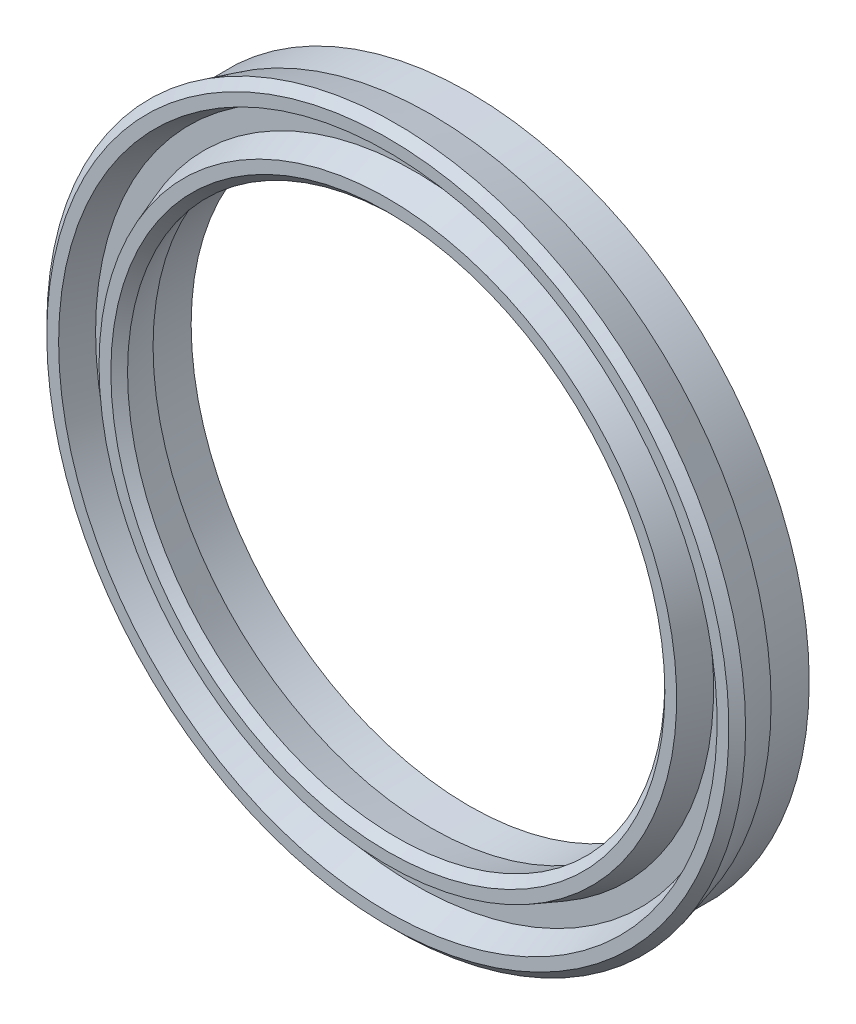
ISO-10303-21;
HEADER;
FILE_DESCRIPTION(('STEP AP214'),'2;1');
FILE_NAME('part.step','',(''),(''),'','','');
FILE_SCHEMA(('AUTOMOTIVE_DESIGN { 1 0 10303 214 1 1 1 1 }'));
ENDSEC;
DATA;
#1=APPLICATION_CONTEXT('core data for automotive mechanical design processes');
#2=APPLICATION_PROTOCOL_DEFINITION('international standard','automotive_design',2000,#1);
#3=PRODUCT_CONTEXT('',#1,'mechanical');
#4=PRODUCT('Part','Part','',(#3));
#5=PRODUCT_RELATED_PRODUCT_CATEGORY('part','',(#4));
#6=PRODUCT_DEFINITION_FORMATION('','',#4);
#7=PRODUCT_DEFINITION_CONTEXT('part definition',#1,'design');
#8=PRODUCT_DEFINITION('design','',#6,#7);
#9=PRODUCT_DEFINITION_SHAPE('','',#8);
#10=(LENGTH_UNIT() NAMED_UNIT(*) SI_UNIT(.MILLI.,.METRE.));
#11=(NAMED_UNIT(*) PLANE_ANGLE_UNIT() SI_UNIT($,.RADIAN.));
#12=(NAMED_UNIT(*) SI_UNIT($,.STERADIAN.) SOLID_ANGLE_UNIT());
#13=UNCERTAINTY_MEASURE_WITH_UNIT(LENGTH_MEASURE(1.E-05),#10,'distance_accuracy_value','');
#14=(GEOMETRIC_REPRESENTATION_CONTEXT(3) GLOBAL_UNCERTAINTY_ASSIGNED_CONTEXT((#13)) GLOBAL_UNIT_ASSIGNED_CONTEXT((#10,
#11,#12)) REPRESENTATION_CONTEXT('',''));
#15=CARTESIAN_POINT('',(0.,0.,0.));
#16=DIRECTION('',(0.,0.,1.));
#17=DIRECTION('',(1.,0.,0.));
#18=AXIS2_PLACEMENT_3D('',#15,#16,#17);
#19=CARTESIAN_POINT('',(0.,0.,0.));
#20=DIRECTION('',(0.,0.,-1.));
#21=DIRECTION('',(-1.,0.,0.));
#22=AXIS2_PLACEMENT_3D('',#19,#20,#21);
#23=CONICAL_SURFACE('',#22,52.5710801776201,0.349065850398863);
#24=CARTESIAN_POINT('',(0.,0.,-4.93333333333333));
#25=DIRECTION('',(0.,0.,-1.));
#26=DIRECTION('',(-1.,0.,0.));
#27=AXIS2_PLACEMENT_3D('',#24,#25,#26);
#28=CIRCLE('',#27,54.3666666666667);
#29=CARTESIAN_POINT('',(-54.3666666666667,0.,-4.93333333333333));
#30=VERTEX_POINT('',#29);
#31=EDGE_CURVE('E10',#30,#30,#28,.T.);
#32=ORIENTED_EDGE('',*,*,#31,.F.);
#33=EDGE_LOOP('',(#32));
#34=FACE_BOUND('',#33,.T.);
#35=CARTESIAN_POINT('',(0.,0.,0.));
#36=DIRECTION('',(0.,0.,-1.));
#37=DIRECTION('',(-1.,0.,0.));
#38=AXIS2_PLACEMENT_3D('',#35,#36,#37);
#39=CIRCLE('',#38,52.5710801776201);
#40=CARTESIAN_POINT('',(-52.5710801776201,0.,0.));
#41=VERTEX_POINT('',#40);
#42=EDGE_CURVE('E71',#41,#41,#39,.T.);
#43=ORIENTED_EDGE('',*,*,#42,.T.);
#44=EDGE_LOOP('',(#43));
#45=FACE_BOUND('',#44,.T.);
#46=ADVANCED_FACE('F31',(#34,#45),#23,.T.);
#47=CARTESIAN_POINT('',(58.1333333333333,0.,-4.93333333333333));
#48=DIRECTION('',(0.,0.,-1.));
#49=DIRECTION('',(-1.,0.,0.));
#50=AXIS2_PLACEMENT_3D('',#47,#48,#49);
#51=PLANE('',#50);
#52=CARTESIAN_POINT('',(0.,0.,-4.93333333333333));
#53=DIRECTION('',(0.,0.,-1.));
#54=DIRECTION('',(-1.,0.,0.));
#55=AXIS2_PLACEMENT_3D('',#52,#53,#54);
#56=CIRCLE('',#55,58.1333333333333);
#57=CARTESIAN_POINT('',(-58.1333333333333,0.,-4.93333333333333));
#58=VERTEX_POINT('',#57);
#59=EDGE_CURVE('E37',#58,#58,#56,.T.);
#60=ORIENTED_EDGE('',*,*,#59,.F.);
#61=EDGE_LOOP('',(#60));
#62=FACE_BOUND('',#61,.T.);
#63=ORIENTED_EDGE('',*,*,#31,.T.);
#64=EDGE_LOOP('',(#63));
#65=FACE_BOUND('',#64,.T.);
#66=ADVANCED_FACE('F132',(#62,#65),#51,.F.);
#67=CARTESIAN_POINT('',(0.,0.,-4.93333333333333));
#68=DIRECTION('',(0.,0.,1.));
#69=DIRECTION('',(1.,0.,0.));
#70=AXIS2_PLACEMENT_3D('',#67,#68,#69);
#71=CONICAL_SURFACE('',#70,58.1333333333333,0.349065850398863);
#72=CARTESIAN_POINT('',(0.,0.,0.));
#73=DIRECTION('',(0.,0.,-1.));
#74=DIRECTION('',(-1.,0.,0.));
#75=AXIS2_PLACEMENT_3D('',#72,#73,#74);
#76=CIRCLE('',#75,59.9289198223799);
#77=CARTESIAN_POINT('',(-59.9289198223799,0.,0.));
#78=VERTEX_POINT('',#77);
#79=EDGE_CURVE('E41',#78,#78,#76,.T.);
#80=ORIENTED_EDGE('',*,*,#79,.F.);
#81=EDGE_LOOP('',(#80));
#82=FACE_BOUND('',#81,.T.);
#83=ORIENTED_EDGE('',*,*,#59,.T.);
#84=EDGE_LOOP('',(#83));
#85=FACE_BOUND('',#84,.T.);
#86=ADVANCED_FACE('F127',(#82,#85),#71,.F.);
#87=CARTESIAN_POINT('',(62.0793888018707,0.,0.));
#88=DIRECTION('',(0.,0.,-1.));
#89=DIRECTION('',(-1.,0.,0.));
#90=AXIS2_PLACEMENT_3D('',#87,#88,#89);
#91=PLANE('',#90);
#92=CARTESIAN_POINT('',(0.,0.,0.));
#93=DIRECTION('',(0.,0.,-1.));
#94=DIRECTION('',(-1.,0.,0.));
#95=AXIS2_PLACEMENT_3D('',#92,#93,#94);
#96=CIRCLE('',#95,62.0793888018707);
#97=CARTESIAN_POINT('',(-62.0793888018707,0.,0.));
#98=VERTEX_POINT('',#97);
#99=EDGE_CURVE('E45',#98,#98,#96,.T.);
#100=ORIENTED_EDGE('',*,*,#99,.F.);
#101=EDGE_LOOP('',(#100));
#102=FACE_BOUND('',#101,.T.);
#103=ORIENTED_EDGE('',*,*,#79,.T.);
#104=EDGE_LOOP('',(#103));
#105=FACE_BOUND('',#104,.T.);
#106=ADVANCED_FACE('F121',(#102,#105),#91,.F.);
#107=CARTESIAN_POINT('',(0.,0.,0.));
#108=DIRECTION('',(0.,0.,-1.));
#109=DIRECTION('',(-1.,0.,0.));
#110=AXIS2_PLACEMENT_3D('',#107,#108,#109);
#111=CONICAL_SURFACE('',#110,62.0793888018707,0.785398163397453);
#112=CARTESIAN_POINT('',(0.,0.,-1.52061119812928));
#113=DIRECTION('',(0.,0.,-1.));
#114=DIRECTION('',(-1.,0.,0.));
#115=AXIS2_PLACEMENT_3D('',#112,#113,#114);
#116=CIRCLE('',#115,63.6);
#117=CARTESIAN_POINT('',(-63.6,0.,-1.52061119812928));
#118=VERTEX_POINT('',#117);
#119=EDGE_CURVE('E50',#118,#118,#116,.T.);
#120=ORIENTED_EDGE('',*,*,#119,.F.);
#121=EDGE_LOOP('',(#120));
#122=FACE_BOUND('',#121,.T.);
#123=ORIENTED_EDGE('',*,*,#99,.T.);
#124=EDGE_LOOP('',(#123));
#125=FACE_BOUND('',#124,.T.);
#126=ADVANCED_FACE('F115',(#122,#125),#111,.T.);
#127=CARTESIAN_POINT('',(0.,0.,-1.52061119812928));
#128=DIRECTION('',(0.,0.,1.));
#129=DIRECTION('',(1.,0.,0.));
#130=AXIS2_PLACEMENT_3D('',#127,#128,#129);
#131=CONICAL_SURFACE('',#130,63.6,0.261799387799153);
#132=CARTESIAN_POINT('',(0.,0.,-7.86509757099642));
#133=DIRECTION('',(0.,0.,-1.));
#134=DIRECTION('',(-1.,0.,0.));
#135=AXIS2_PLACEMENT_3D('',#132,#133,#134);
#136=CIRCLE('',#135,61.9);
#137=CARTESIAN_POINT('',(-61.9,0.,-7.86509757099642));
#138=VERTEX_POINT('',#137);
#139=EDGE_CURVE('E53',#138,#138,#136,.T.);
#140=ORIENTED_EDGE('',*,*,#139,.F.);
#141=EDGE_LOOP('',(#140));
#142=FACE_BOUND('',#141,.T.);
#143=ORIENTED_EDGE('',*,*,#119,.T.);
#144=EDGE_LOOP('',(#143));
#145=FACE_BOUND('',#144,.T.);
#146=ADVANCED_FACE('F109',(#142,#145),#131,.T.);
#147=CARTESIAN_POINT('',(0.,0.,-14.8));
#148=DIRECTION('',(0.,0.,-1.));
#149=DIRECTION('',(-1.,0.,0.));
#150=AXIS2_PLACEMENT_3D('',#147,#148,#149);
#151=CYLINDRICAL_SURFACE('',#150,61.9);
#152=CARTESIAN_POINT('',(0.,0.,-14.8));
#153=DIRECTION('',(0.,0.,-1.));
#154=DIRECTION('',(-1.,0.,0.));
#155=AXIS2_PLACEMENT_3D('',#152,#153,#154);
#156=CIRCLE('',#155,61.9);
#157=CARTESIAN_POINT('',(-61.9,0.,-14.8));
#158=VERTEX_POINT('',#157);
#159=EDGE_CURVE('E56',#158,#158,#156,.T.);
#160=ORIENTED_EDGE('',*,*,#159,.F.);
#161=EDGE_LOOP('',(#160));
#162=FACE_BOUND('',#161,.T.);
#163=ORIENTED_EDGE('',*,*,#139,.T.);
#164=EDGE_LOOP('',(#163));
#165=FACE_BOUND('',#164,.T.);
#166=ADVANCED_FACE('F103',(#162,#165),#151,.T.);
#167=CARTESIAN_POINT('',(50.6,0.,-14.8));
#168=DIRECTION('',(0.,0.,1.));
#169=DIRECTION('',(1.,0.,0.));
#170=AXIS2_PLACEMENT_3D('',#167,#168,#169);
#171=PLANE('',#170);
#172=CARTESIAN_POINT('',(0.,0.,-14.8));
#173=DIRECTION('',(0.,0.,-1.));
#174=DIRECTION('',(-1.,0.,0.));
#175=AXIS2_PLACEMENT_3D('',#172,#173,#174);
#176=CIRCLE('',#175,50.6);
#177=CARTESIAN_POINT('',(-50.6,0.,-14.8));
#178=VERTEX_POINT('',#177);
#179=EDGE_CURVE('E59',#178,#178,#176,.T.);
#180=ORIENTED_EDGE('',*,*,#179,.F.);
#181=EDGE_LOOP('',(#180));
#182=FACE_BOUND('',#181,.T.);
#183=ORIENTED_EDGE('',*,*,#159,.T.);
#184=EDGE_LOOP('',(#183));
#185=FACE_BOUND('',#184,.T.);
#186=ADVANCED_FACE('F97',(#182,#185),#171,.F.);
#187=CARTESIAN_POINT('',(0.,0.,-14.8));
#188=DIRECTION('',(0.,0.,-1.));
#189=DIRECTION('',(-1.,0.,0.));
#190=AXIS2_PLACEMENT_3D('',#187,#188,#189);
#191=CYLINDRICAL_SURFACE('',#190,50.6);
#192=CARTESIAN_POINT('',(0.,0.,-7.86509757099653));
#193=DIRECTION('',(0.,0.,-1.));
#194=DIRECTION('',(-1.,0.,0.));
#195=AXIS2_PLACEMENT_3D('',#192,#193,#194);
#196=CIRCLE('',#195,50.6);
#197=CARTESIAN_POINT('',(-50.6,0.,-7.86509757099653));
#198=VERTEX_POINT('',#197);
#199=EDGE_CURVE('E62',#198,#198,#196,.T.);
#200=ORIENTED_EDGE('',*,*,#199,.F.);
#201=EDGE_LOOP('',(#200));
#202=FACE_BOUND('',#201,.T.);
#203=ORIENTED_EDGE('',*,*,#179,.T.);
#204=EDGE_LOOP('',(#203));
#205=FACE_BOUND('',#204,.T.);
#206=ADVANCED_FACE('F91',(#202,#205),#191,.F.);
#207=CARTESIAN_POINT('',(0.,0.,-7.86509757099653));
#208=DIRECTION('',(0.,0.,-1.));
#209=DIRECTION('',(-1.,0.,0.));
#210=AXIS2_PLACEMENT_3D('',#207,#208,#209);
#211=CONICAL_SURFACE('',#210,50.6,0.261799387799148);
#212=CARTESIAN_POINT('',(0.,0.,-1.52061119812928));
#213=DIRECTION('',(0.,0.,-1.));
#214=DIRECTION('',(-1.,0.,0.));
#215=AXIS2_PLACEMENT_3D('',#212,#213,#214);
#216=CIRCLE('',#215,48.9);
#217=CARTESIAN_POINT('',(-48.9,0.,-1.52061119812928));
#218=VERTEX_POINT('',#217);
#219=EDGE_CURVE('E65',#218,#218,#216,.T.);
#220=ORIENTED_EDGE('',*,*,#219,.F.);
#221=EDGE_LOOP('',(#220));
#222=FACE_BOUND('',#221,.T.);
#223=ORIENTED_EDGE('',*,*,#199,.T.);
#224=EDGE_LOOP('',(#223));
#225=FACE_BOUND('',#224,.T.);
#226=ADVANCED_FACE('F85',(#222,#225),#211,.F.);
#227=CARTESIAN_POINT('',(0.,0.,-1.52061119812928));
#228=DIRECTION('',(0.,0.,1.));
#229=DIRECTION('',(1.,0.,0.));
#230=AXIS2_PLACEMENT_3D('',#227,#228,#229);
#231=CONICAL_SURFACE('',#230,48.9,0.785398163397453);
#232=CARTESIAN_POINT('',(0.,0.,0.));
#233=DIRECTION('',(0.,0.,-1.));
#234=DIRECTION('',(-1.,0.,0.));
#235=AXIS2_PLACEMENT_3D('',#232,#233,#234);
#236=CIRCLE('',#235,50.4206111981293);
#237=CARTESIAN_POINT('',(-50.4206111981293,0.,0.));
#238=VERTEX_POINT('',#237);
#239=EDGE_CURVE('E68',#238,#238,#236,.T.);
#240=ORIENTED_EDGE('',*,*,#239,.F.);
#241=EDGE_LOOP('',(#240));
#242=FACE_BOUND('',#241,.T.);
#243=ORIENTED_EDGE('',*,*,#219,.T.);
#244=EDGE_LOOP('',(#243));
#245=FACE_BOUND('',#244,.T.);
#246=ADVANCED_FACE('F79',(#242,#245),#231,.F.);
#247=CARTESIAN_POINT('',(50.4206111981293,0.,0.));
#248=DIRECTION('',(0.,0.,-1.));
#249=DIRECTION('',(-1.,0.,0.));
#250=AXIS2_PLACEMENT_3D('',#247,#248,#249);
#251=PLANE('',#250);
#252=ORIENTED_EDGE('',*,*,#42,.F.);
#253=EDGE_LOOP('',(#252));
#254=FACE_BOUND('',#253,.T.);
#255=ORIENTED_EDGE('',*,*,#239,.T.);
#256=EDGE_LOOP('',(#255));
#257=FACE_BOUND('',#256,.T.);
#258=ADVANCED_FACE('F76',(#254,#257),#251,.F.);
#259=CLOSED_SHELL('',(#46,#66,#86,#106,#126,#146,#166,#186,#206,#226,#246,#258));
#260=MANIFOLD_SOLID_BREP('B2',#259);
#261=ADVANCED_BREP_SHAPE_REPRESENTATION('',(#18,#260),#14);
#262=SHAPE_DEFINITION_REPRESENTATION(#9,#261);
ENDSEC;
END-ISO-10303-21;
